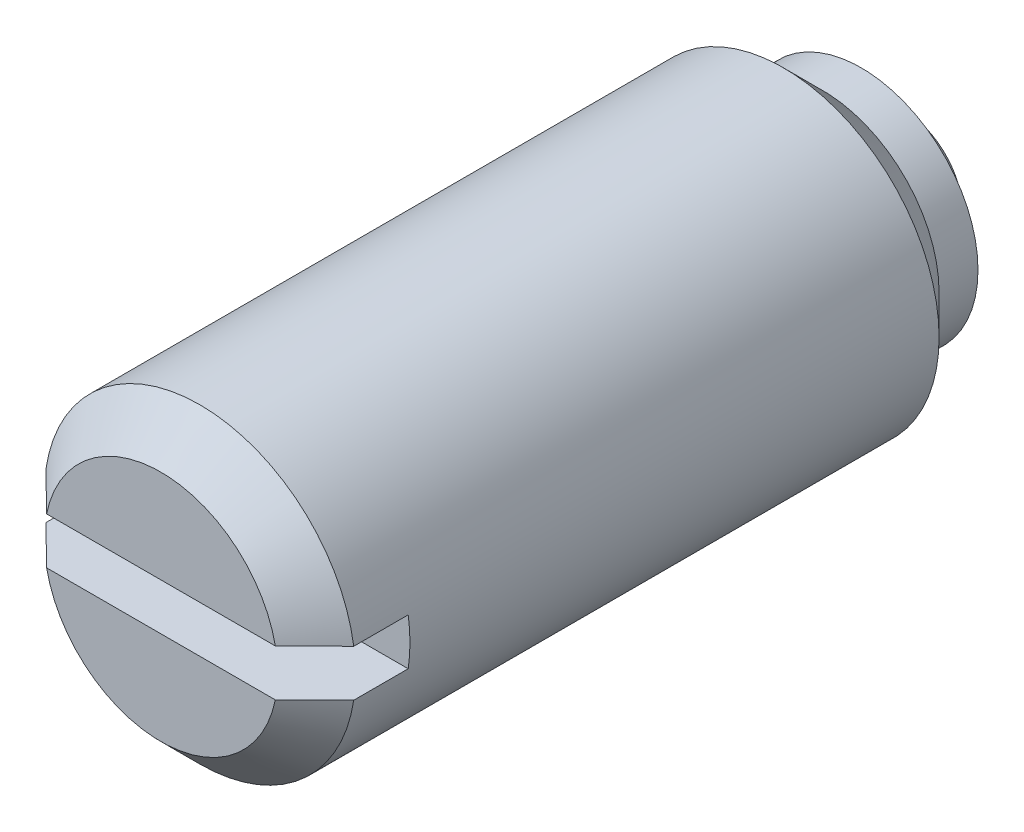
ISO-10303-21;
HEADER;
FILE_DESCRIPTION(('STEP AP214'),'2;1');
FILE_NAME('part.step','',(''),(''),'','','');
FILE_SCHEMA(('AUTOMOTIVE_DESIGN { 1 0 10303 214 1 1 1 1 }'));
ENDSEC;
DATA;
#1=APPLICATION_CONTEXT('core data for automotive mechanical design processes');
#2=APPLICATION_PROTOCOL_DEFINITION('international standard','automotive_design',2000,#1);
#3=PRODUCT_CONTEXT('',#1,'mechanical');
#4=PRODUCT('Part','Part','',(#3));
#5=PRODUCT_RELATED_PRODUCT_CATEGORY('part','',(#4));
#6=PRODUCT_DEFINITION_FORMATION('','',#4);
#7=PRODUCT_DEFINITION_CONTEXT('part definition',#1,'design');
#8=PRODUCT_DEFINITION('design','',#6,#7);
#9=PRODUCT_DEFINITION_SHAPE('','',#8);
#10=(LENGTH_UNIT() NAMED_UNIT(*) SI_UNIT(.MILLI.,.METRE.));
#11=(NAMED_UNIT(*) PLANE_ANGLE_UNIT() SI_UNIT($,.RADIAN.));
#12=(NAMED_UNIT(*) SI_UNIT($,.STERADIAN.) SOLID_ANGLE_UNIT());
#13=UNCERTAINTY_MEASURE_WITH_UNIT(LENGTH_MEASURE(1.E-05),#10,'distance_accuracy_value','');
#14=(GEOMETRIC_REPRESENTATION_CONTEXT(3) GLOBAL_UNCERTAINTY_ASSIGNED_CONTEXT((#13)) GLOBAL_UNIT_ASSIGNED_CONTEXT((#10,
#11,#12)) REPRESENTATION_CONTEXT('',''));
#15=CARTESIAN_POINT('',(0.,0.,0.));
#16=DIRECTION('',(0.,0.,1.));
#17=DIRECTION('',(1.,0.,0.));
#18=AXIS2_PLACEMENT_3D('',#15,#16,#17);
#19=CARTESIAN_POINT('',(0.,0.,-10.2));
#20=DIRECTION('',(0.,0.,-1.));
#21=DIRECTION('',(-1.,0.,0.));
#22=AXIS2_PLACEMENT_3D('',#19,#20,#21);
#23=CYLINDRICAL_SURFACE('',#22,2.);
#24=DIRECTION('',(0.,0.,1.));
#25=VECTOR('',#24,1.);
#26=CARTESIAN_POINT('',(1.97737199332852,-0.3,8.6));
#27=LINE('',#26,#25);
#28=CARTESIAN_POINT('',(1.97737199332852,-0.3,8.6));
#29=VERTEX_POINT('',#28);
#30=CARTESIAN_POINT('',(1.97737199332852,-0.3,9.3));
#31=VERTEX_POINT('',#30);
#32=EDGE_CURVE('E84',#29,#31,#27,.T.);
#33=ORIENTED_EDGE('',*,*,#32,.T.);
#34=CARTESIAN_POINT('',(0.,0.,9.3));
#35=DIRECTION('',(0.,0.,1.));
#36=DIRECTION('',(1.,0.,0.));
#37=AXIS2_PLACEMENT_3D('',#34,#35,#36);
#38=CIRCLE('',#37,2.);
#39=CARTESIAN_POINT('',(-1.97737199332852,-0.3,9.3));
#40=VERTEX_POINT('',#39);
#41=EDGE_CURVE('E90',#31,#40,#38,.F.);
#42=ORIENTED_EDGE('',*,*,#41,.T.);
#43=DIRECTION('',(0.,0.,1.));
#44=VECTOR('',#43,1.);
#45=CARTESIAN_POINT('',(-1.97737199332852,-0.3,8.6));
#46=LINE('',#45,#44);
#47=CARTESIAN_POINT('',(-1.97737199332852,-0.3,8.6));
#48=VERTEX_POINT('',#47);
#49=EDGE_CURVE('E82',#48,#40,#46,.T.);
#50=ORIENTED_EDGE('',*,*,#49,.F.);
#51=CARTESIAN_POINT('',(0.,0.,8.6));
#52=DIRECTION('',(0.,0.,1.));
#53=DIRECTION('',(1.,0.,0.));
#54=AXIS2_PLACEMENT_3D('',#51,#52,#53);
#55=CIRCLE('',#54,2.);
#56=CARTESIAN_POINT('',(-1.97737199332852,0.3,8.6));
#57=VERTEX_POINT('',#56);
#58=EDGE_CURVE('E66',#57,#48,#55,.T.);
#59=ORIENTED_EDGE('',*,*,#58,.F.);
#60=DIRECTION('',(0.,0.,1.));
#61=VECTOR('',#60,1.);
#62=CARTESIAN_POINT('',(-1.97737199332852,0.3,8.6));
#63=LINE('',#62,#61);
#64=CARTESIAN_POINT('',(-1.97737199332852,0.3,9.3));
#65=VERTEX_POINT('',#64);
#66=EDGE_CURVE('E97',#57,#65,#63,.T.);
#67=ORIENTED_EDGE('',*,*,#66,.T.);
#68=CARTESIAN_POINT('',(0.,0.,9.3));
#69=DIRECTION('',(0.,0.,1.));
#70=DIRECTION('',(1.,0.,0.));
#71=AXIS2_PLACEMENT_3D('',#68,#69,#70);
#72=CIRCLE('',#71,2.);
#73=CARTESIAN_POINT('',(1.97737199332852,0.3,9.3));
#74=VERTEX_POINT('',#73);
#75=EDGE_CURVE('E102',#65,#74,#72,.F.);
#76=ORIENTED_EDGE('',*,*,#75,.T.);
#77=DIRECTION('',(0.,0.,1.));
#78=VECTOR('',#77,1.);
#79=CARTESIAN_POINT('',(1.97737199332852,0.3,8.6));
#80=LINE('',#79,#78);
#81=CARTESIAN_POINT('',(1.97737199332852,0.3,8.6));
#82=VERTEX_POINT('',#81);
#83=EDGE_CURVE('E92',#82,#74,#80,.T.);
#84=ORIENTED_EDGE('',*,*,#83,.F.);
#85=EDGE_CURVE('E78',#29,#82,#55,.T.);
#86=ORIENTED_EDGE('',*,*,#85,.F.);
#87=EDGE_LOOP('',(#33,#42,#50,#59,#67,#76,#84,#86));
#88=FACE_BOUND('',#87,.T.);
#89=CARTESIAN_POINT('',(0.,0.,1.8));
#90=DIRECTION('',(0.,0.,1.));
#91=DIRECTION('',(1.,0.,0.));
#92=AXIS2_PLACEMENT_3D('',#89,#90,#91);
#93=CIRCLE('',#92,2.);
#94=CARTESIAN_POINT('',(2.,0.,1.8));
#95=VERTEX_POINT('',#94);
#96=EDGE_CURVE('E165',#95,#95,#93,.T.);
#97=ORIENTED_EDGE('',*,*,#96,.T.);
#98=EDGE_LOOP('',(#97));
#99=FACE_BOUND('',#98,.T.);
#100=ADVANCED_FACE('F15',(#88,#99),#23,.T.);
#101=CARTESIAN_POINT('',(0.,2.,9.8));
#102=DIRECTION('',(0.,0.,1.));
#103=DIRECTION('',(1.,0.,0.));
#104=AXIS2_PLACEMENT_3D('',#101,#102,#103);
#105=PLANE('',#104);
#106=DIRECTION('',(1.,0.,0.));
#107=VECTOR('',#106,1.);
#108=CARTESIAN_POINT('',(-1.97737199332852,0.3,9.8));
#109=LINE('',#108,#107);
#110=CARTESIAN_POINT('',(-1.46969384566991,0.3,9.8));
#111=VERTEX_POINT('',#110);
#112=CARTESIAN_POINT('',(1.46969384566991,0.3,9.8));
#113=VERTEX_POINT('',#112);
#114=EDGE_CURVE('E76',#111,#113,#109,.T.);
#115=ORIENTED_EDGE('',*,*,#114,.T.);
#116=CARTESIAN_POINT('',(0.,0.,9.8));
#117=DIRECTION('',(0.,0.,1.));
#118=DIRECTION('',(1.,0.,0.));
#119=AXIS2_PLACEMENT_3D('',#116,#117,#118);
#120=CIRCLE('',#119,1.5);
#121=EDGE_CURVE('E9',#113,#111,#120,.T.);
#122=ORIENTED_EDGE('',*,*,#121,.T.);
#123=EDGE_LOOP('',(#115,#122));
#124=FACE_BOUND('',#123,.T.);
#125=ADVANCED_FACE('F182',(#124),#105,.T.);
#126=DIRECTION('',(1.,0.,0.));
#127=VECTOR('',#126,1.);
#128=CARTESIAN_POINT('',(-1.97737199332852,-0.3,9.8));
#129=LINE('',#128,#127);
#130=CARTESIAN_POINT('',(-1.46969384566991,-0.3,9.8));
#131=VERTEX_POINT('',#130);
#132=CARTESIAN_POINT('',(1.46969384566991,-0.3,9.8));
#133=VERTEX_POINT('',#132);
#134=EDGE_CURVE('E152',#131,#133,#129,.T.);
#135=ORIENTED_EDGE('',*,*,#134,.F.);
#136=CARTESIAN_POINT('',(0.,0.,9.8));
#137=DIRECTION('',(0.,0.,1.));
#138=DIRECTION('',(1.,0.,0.));
#139=AXIS2_PLACEMENT_3D('',#136,#137,#138);
#140=CIRCLE('',#139,1.5);
#141=EDGE_CURVE('E146',#131,#133,#140,.T.);
#142=ORIENTED_EDGE('',*,*,#141,.T.);
#143=EDGE_LOOP('',(#135,#142));
#144=FACE_BOUND('',#143,.T.);
#145=ADVANCED_FACE('F132',(#144),#105,.T.);
#146=CARTESIAN_POINT('',(-1.97737199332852,0.3,8.6));
#147=DIRECTION('',(0.,-1.,0.));
#148=DIRECTION('',(1.,0.,0.));
#149=AXIS2_PLACEMENT_3D('',#146,#147,#148);
#150=PLANE('',#149);
#151=ORIENTED_EDGE('',*,*,#83,.T.);
#152=CARTESIAN_POINT('',(1.97737199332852,0.3,9.3));
#153=CARTESIAN_POINT('',(1.89291452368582,0.3,9.38349095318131));
#154=CARTESIAN_POINT('',(1.80840793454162,0.3,9.4669324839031));
#155=CARTESIAN_POINT('',(1.68150992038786,0.3,9.59195449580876));
#156=CARTESIAN_POINT('',(1.63918756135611,0.3,9.63360511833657));
#157=CARTESIAN_POINT('',(1.55448600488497,0.3,9.71684862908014));
#158=CARTESIAN_POINT('',(1.51210680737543,0.3,9.75844151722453));
#159=CARTESIAN_POINT('',(1.46969384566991,0.3,9.8));
#160=B_SPLINE_CURVE_WITH_KNOTS('',3,(#152,#153,#154,#155,#156,#157,#158,#159),.UNSPECIFIED.,.F.,
.F.,(4,2,2,4),(0.,0.35627852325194,0.534417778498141,0.712557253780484),.UNSPECIFIED.);
#161=EDGE_CURVE('E24',#74,#113,#160,.T.);
#162=ORIENTED_EDGE('',*,*,#161,.T.);
#163=ORIENTED_EDGE('',*,*,#114,.F.);
#164=CARTESIAN_POINT('',(-1.46969384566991,0.3,9.8));
#165=CARTESIAN_POINT('',(-1.51210680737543,0.3,9.75844151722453));
#166=CARTESIAN_POINT('',(-1.55448600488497,0.3,9.71684862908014));
#167=CARTESIAN_POINT('',(-1.63918756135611,0.3,9.63360511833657));
#168=CARTESIAN_POINT('',(-1.68150992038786,0.3,9.59195449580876));
#169=CARTESIAN_POINT('',(-1.80840793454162,0.3,9.4669324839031));
#170=CARTESIAN_POINT('',(-1.89291452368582,0.3,9.38349095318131));
#171=CARTESIAN_POINT('',(-1.97737199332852,0.3,9.3));
#172=B_SPLINE_CURVE_WITH_KNOTS('',3,(#164,#165,#166,#167,#168,#169,#170,#171),.UNSPECIFIED.,.F.,
.F.,(4,2,2,4),(0.,0.178139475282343,0.356278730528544,0.712557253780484),.UNSPECIFIED.);
#173=EDGE_CURVE('E137',#111,#65,#172,.T.);
#174=ORIENTED_EDGE('',*,*,#173,.T.);
#175=ORIENTED_EDGE('',*,*,#66,.F.);
#176=DIRECTION('',(1.,0.,0.));
#177=VECTOR('',#176,1.);
#178=CARTESIAN_POINT('',(-1.97737199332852,0.3,8.6));
#179=LINE('',#178,#177);
#180=EDGE_CURVE('E72',#57,#82,#179,.T.);
#181=ORIENTED_EDGE('',*,*,#180,.T.);
#182=EDGE_LOOP('',(#151,#162,#163,#174,#175,#181));
#183=FACE_BOUND('',#182,.T.);
#184=ADVANCED_FACE('F126',(#183),#150,.T.);
#185=CARTESIAN_POINT('',(-1.97737199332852,-0.3,8.6));
#186=DIRECTION('',(0.,-1.,0.));
#187=DIRECTION('',(1.,0.,0.));
#188=AXIS2_PLACEMENT_3D('',#185,#186,#187);
#189=PLANE('',#188);
#190=ORIENTED_EDGE('',*,*,#49,.T.);
#191=CARTESIAN_POINT('',(-1.97737199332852,-0.3,9.3));
#192=CARTESIAN_POINT('',(-1.89291452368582,-0.3,9.38349095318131));
#193=CARTESIAN_POINT('',(-1.80840793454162,-0.3,9.4669324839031));
#194=CARTESIAN_POINT('',(-1.68150992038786,-0.3,9.59195449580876));
#195=CARTESIAN_POINT('',(-1.63918756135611,-0.3,9.63360511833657));
#196=CARTESIAN_POINT('',(-1.55448600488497,-0.3,9.71684862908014));
#197=CARTESIAN_POINT('',(-1.51210680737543,-0.3,9.75844151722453));
#198=CARTESIAN_POINT('',(-1.46969384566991,-0.3,9.8));
#199=B_SPLINE_CURVE_WITH_KNOTS('',3,(#191,#192,#193,#194,#195,#196,#197,#198),.UNSPECIFIED.,.F.,
.F.,(4,2,2,4),(0.,0.35627852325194,0.534417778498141,0.712557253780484),.UNSPECIFIED.);
#200=EDGE_CURVE('E113',#40,#131,#199,.T.);
#201=ORIENTED_EDGE('',*,*,#200,.T.);
#202=ORIENTED_EDGE('',*,*,#134,.T.);
#203=CARTESIAN_POINT('',(1.46969384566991,-0.3,9.8));
#204=CARTESIAN_POINT('',(1.51210680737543,-0.3,9.75844151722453));
#205=CARTESIAN_POINT('',(1.55448600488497,-0.3,9.71684862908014));
#206=CARTESIAN_POINT('',(1.63918756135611,-0.3,9.63360511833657));
#207=CARTESIAN_POINT('',(1.68150992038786,-0.3,9.59195449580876));
#208=CARTESIAN_POINT('',(1.80840793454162,-0.3,9.4669324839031));
#209=CARTESIAN_POINT('',(1.89291452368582,-0.3,9.38349095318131));
#210=CARTESIAN_POINT('',(1.97737199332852,-0.3,9.3));
#211=B_SPLINE_CURVE_WITH_KNOTS('',3,(#203,#204,#205,#206,#207,#208,#209,#210),.UNSPECIFIED.,.F.,
.F.,(4,2,2,4),(0.,0.178139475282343,0.356278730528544,0.712557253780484),.UNSPECIFIED.);
#212=EDGE_CURVE('E106',#133,#31,#211,.T.);
#213=ORIENTED_EDGE('',*,*,#212,.T.);
#214=ORIENTED_EDGE('',*,*,#32,.F.);
#215=DIRECTION('',(1.,0.,0.));
#216=VECTOR('',#215,1.);
#217=CARTESIAN_POINT('',(-1.97737199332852,-0.3,8.6));
#218=LINE('',#217,#216);
#219=EDGE_CURVE('E69',#48,#29,#218,.T.);
#220=ORIENTED_EDGE('',*,*,#219,.F.);
#221=EDGE_LOOP('',(#190,#201,#202,#213,#214,#220));
#222=FACE_BOUND('',#221,.T.);
#223=ADVANCED_FACE('F81',(#222),#189,.F.);
#224=CARTESIAN_POINT('',(0.,0.,8.6));
#225=DIRECTION('',(0.,0.,1.));
#226=DIRECTION('',(1.,0.,0.));
#227=AXIS2_PLACEMENT_3D('',#224,#225,#226);
#228=PLANE('',#227);
#229=ORIENTED_EDGE('',*,*,#58,.T.);
#230=ORIENTED_EDGE('',*,*,#219,.T.);
#231=ORIENTED_EDGE('',*,*,#85,.T.);
#232=ORIENTED_EDGE('',*,*,#180,.F.);
#233=EDGE_LOOP('',(#229,#230,#231,#232));
#234=FACE_BOUND('',#233,.T.);
#235=ADVANCED_FACE('F68',(#234),#228,.T.);
#236=CARTESIAN_POINT('',(0.,0.,9.3));
#237=DIRECTION('',(0.,0.,-1.));
#238=DIRECTION('',(-1.,0.,0.));
#239=AXIS2_PLACEMENT_3D('',#236,#237,#238);
#240=CONICAL_SURFACE('',#239,2.,0.78539816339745);
#241=ORIENTED_EDGE('',*,*,#212,.F.);
#242=ORIENTED_EDGE('',*,*,#141,.F.);
#243=ORIENTED_EDGE('',*,*,#200,.F.);
#244=ORIENTED_EDGE('',*,*,#41,.F.);
#245=EDGE_LOOP('',(#241,#242,#243,#244));
#246=FACE_BOUND('',#245,.T.);
#247=ADVANCED_FACE('F119',(#246),#240,.T.);
#248=CARTESIAN_POINT('',(0.,0.,9.3));
#249=DIRECTION('',(0.,0.,-1.));
#250=DIRECTION('',(-1.,0.,0.));
#251=AXIS2_PLACEMENT_3D('',#248,#249,#250);
#252=CONICAL_SURFACE('',#251,2.,0.78539816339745);
#253=ORIENTED_EDGE('',*,*,#173,.F.);
#254=ORIENTED_EDGE('',*,*,#121,.F.);
#255=ORIENTED_EDGE('',*,*,#161,.F.);
#256=ORIENTED_EDGE('',*,*,#75,.F.);
#257=EDGE_LOOP('',(#253,#254,#255,#256));
#258=FACE_BOUND('',#257,.T.);
#259=ADVANCED_FACE('F17',(#258),#252,.T.);
#260=CARTESIAN_POINT('',(0.,0.,1.8));
#261=DIRECTION('',(0.,0.,1.));
#262=DIRECTION('',(1.,0.,0.));
#263=AXIS2_PLACEMENT_3D('',#260,#261,#262);
#264=CONICAL_SURFACE('',#263,2.,0.785398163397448);
#265=CARTESIAN_POINT('',(0.,0.,1.3));
#266=DIRECTION('',(0.,0.,1.));
#267=DIRECTION('',(1.,0.,0.));
#268=AXIS2_PLACEMENT_3D('',#265,#266,#267);
#269=CIRCLE('',#268,1.5);
#270=CARTESIAN_POINT('',(1.5,0.,1.3));
#271=VERTEX_POINT('',#270);
#272=EDGE_CURVE('E162',#271,#271,#269,.T.);
#273=ORIENTED_EDGE('',*,*,#272,.T.);
#274=EDGE_LOOP('',(#273));
#275=FACE_BOUND('',#274,.T.);
#276=ORIENTED_EDGE('',*,*,#96,.F.);
#277=EDGE_LOOP('',(#276));
#278=FACE_BOUND('',#277,.T.);
#279=ADVANCED_FACE('F169',(#275,#278),#264,.T.);
#280=CARTESIAN_POINT('',(0.,0.,1.25));
#281=DIRECTION('',(-1.,0.,0.));
#282=DIRECTION('',(0.,0.,1.));
#283=AXIS2_PLACEMENT_3D('',#280,#281,#282);
#284=SPHERICAL_SURFACE('',#283,1.25);
#285=CARTESIAN_POINT('',(0.,0.,1.25));
#286=DIRECTION('',(0.,0.,-1.));
#287=DIRECTION('',(-1.,0.,0.));
#288=AXIS2_PLACEMENT_3D('',#285,#286,#287);
#289=SPHERICAL_SURFACE('',#288,1.25);
#290=CARTESIAN_POINT('',(0.,0.,0.8));
#291=DIRECTION('',(0.,0.,-1.));
#292=DIRECTION('',(-1.,0.,0.));
#293=AXIS2_PLACEMENT_3D('',#290,#291,#292);
#294=CIRCLE('',#293,1.16619037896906);
#295=CARTESIAN_POINT('',(-1.16619037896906,0.,0.8));
#296=VERTEX_POINT('',#295);
#297=EDGE_CURVE('E99',#296,#296,#294,.T.);
#298=ORIENTED_EDGE('',*,*,#297,.T.);
#299=EDGE_LOOP('',(#298));
#300=FACE_BOUND('',#299,.T.);
#301=ADVANCED_FACE('F171',(#300),#289,.T.);
#302=CARTESIAN_POINT('',(0.,1.16619037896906,0.8));
#303=DIRECTION('',(0.,0.,-1.));
#304=DIRECTION('',(-1.,0.,0.));
#305=AXIS2_PLACEMENT_3D('',#302,#303,#304);
#306=PLANE('',#305);
#307=ORIENTED_EDGE('',*,*,#297,.F.);
#308=EDGE_LOOP('',(#307));
#309=FACE_BOUND('',#308,.T.);
#310=CARTESIAN_POINT('',(0.,0.,0.8));
#311=DIRECTION('',(0.,0.,1.));
#312=DIRECTION('',(1.,0.,0.));
#313=AXIS2_PLACEMENT_3D('',#310,#311,#312);
#314=CIRCLE('',#313,1.5);
#315=CARTESIAN_POINT('',(1.5,0.,0.8));
#316=VERTEX_POINT('',#315);
#317=EDGE_CURVE('E155',#316,#316,#314,.T.);
#318=ORIENTED_EDGE('',*,*,#317,.F.);
#319=EDGE_LOOP('',(#318));
#320=FACE_BOUND('',#319,.T.);
#321=ADVANCED_FACE('F133',(#309,#320),#306,.T.);
#322=CARTESIAN_POINT('',(0.,0.,11.1690333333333));
#323=DIRECTION('',(0.,0.,1.));
#324=DIRECTION('',(1.,0.,0.));
#325=AXIS2_PLACEMENT_3D('',#322,#323,#324);
#326=CYLINDRICAL_SURFACE('',#325,1.5);
#327=ORIENTED_EDGE('',*,*,#317,.T.);
#328=EDGE_LOOP('',(#327));
#329=FACE_BOUND('',#328,.T.);
#330=ORIENTED_EDGE('',*,*,#272,.F.);
#331=EDGE_LOOP('',(#330));
#332=FACE_BOUND('',#331,.T.);
#333=ADVANCED_FACE('F245',(#329,#332),#326,.T.);
#334=CLOSED_SHELL('',(#100,#125,#145,#184,#223,#235,#247,#259,#279,#301,#321,#333));
#335=MANIFOLD_SOLID_BREP('B1',#334);
#336=ADVANCED_BREP_SHAPE_REPRESENTATION('',(#18,#335),#14);
#337=SHAPE_DEFINITION_REPRESENTATION(#9,#336);
ENDSEC;
END-ISO-10303-21;
